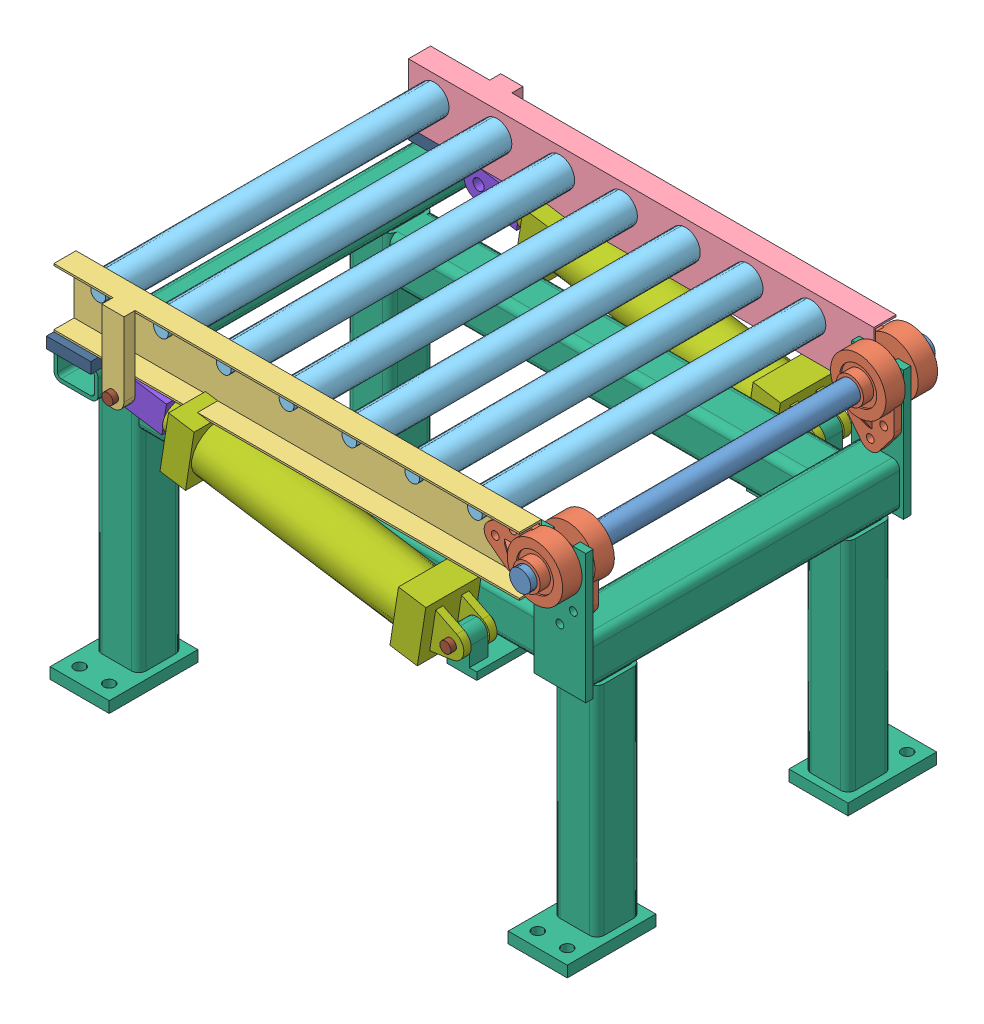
SolidWorks assembly pivoting conv frame.SLDASM, configuration Default (file format 3100). Lengths in mm.
Overall size (889 628.65 704.85).
26 component instances, 11 part files, 35 mates.
Components (placement in the parent):
- pivot shaft-1: pivot shaft.SLDPRT [Default] at (0 -53.975 0) size (36.51 36.51 695.32)
- 3bolt flange1-1: 3bolt flange1.SLDPRT [simple] at (0 -53.975 -266.7) size (95.25 155.58 47.62)
- 3bolt flange1-2: 3bolt flange1.SLDPRT [simple] at (0 -53.975 266.7) x (-1 0 0) z (0 0 -1) size (95.25 155.58 47.62)
- pivot conv-1: pivot conv.SLDASM [Default] at (0 6.35 0) size (873.12 146.05 685.8)
  - pivot_rh_rail1-1: pivot_rh_rail1.SLDPRT [Default] at (-825.5 -12.7 285.75) size (800.1 146.05 57.15)
  - pivot_lh_rail1-1: pivot_lh_rail1.SLDPRT [Default] at (-825.5 -12.7 -285.75) size (800.1 146.05 57.15)
  - conv roller-1: conv roller.SLDPRT [Default] at (-774.7 -44.45 0) size (50.8 50.8 596.9)
  - 3bolt flange1-1: 3bolt flange1.SLDPRT [simple] at (0 -60.325 288.925) x (0 -1 0) z (0 0 1) size (95.25 155.58 47.62)
  - 3bolt flange1-2: 3bolt flange1.SLDPRT [simple] at (0 -60.325 -288.925) x (0 1 0) z (0 0 -1) size (95.25 155.58 47.62)
  - conv roller-8: conv roller.SLDPRT [Default] at (-666.75 -44.45 0) size (50.8 50.8 596.9)
  - conv roller-9: conv roller.SLDPRT [Default] at (-558.8 -44.45 0) size (50.8 50.8 596.9)
  - conv roller-10: conv roller.SLDPRT [Default] at (-450.85 -44.45 0) size (50.8 50.8 596.9)
  - conv roller-11: conv roller.SLDPRT [Default] at (-342.9 -44.45 0) size (50.8 50.8 596.9)
  - conv roller-12: conv roller.SLDPRT [Default] at (-234.95 -44.45 0) size (50.8 50.8 596.9)
  - conv roller-13: conv roller.SLDPRT [Default] at (-127 -44.45 0) size (50.8 50.8 596.9)
- pivot conv frame-1: pivot conv frame.SLDPRT [Default] at origin size (889 609.6 647.7)
- pivot_cylinder-1: pivot_cylinder.SLDPRT [Default] at (-164.7227 -217.3698 304.8) x (0.988116 -0.153707 0) z (0 0 1) size (527.05 95.25 95.25)
- rod_clevis-1: rod_clevis.SLDPRT [Default] at (-635.8301 -144.0864 304.8) x (0.988116 -0.153707 0) z (0 0 1) size (95.25 50.8 38.1)
- pivot cyl rod-1: pivot cyl rod.SLDPRT [Default] at (-234.2595 -206.553 304.8) x (0.988116 -0.153707 0) z (0.107169 0.688946 0.716846) size (444.5 34.92 34.92)
- pivot bumper-1: pivot bumper.SLDPRT [Default] at (-825.5 -127 285.75) size (76.2 19.05 50.8)
- pivot bumper-2: pivot bumper.SLDPRT [Default] at (-825.5 -127 -336.55) size (76.2 19.05 50.8)
- pin .75x3.0-1: pin .75x3.0.SLDPRT [Default] at (-704.85 -133.35 276.225) x (0.350739 -0.936473 0) z (0 0 1) size (19.05 19.05 76.2)
- pin .75x3.0-2: pin .75x3.0.SLDPRT [Default] at (-133.35 -222.25 266.7) x (0.654591 0.755984 0) z (0 0 1) size (19.05 19.05 76.2)
- pivot_cylinder-2: pivot_cylinder.SLDPRT [Default] at (-164.7227 -217.3698 -304.8) x (0.988116 -0.153707 0) z (0 0 1) size (527.05 95.25 95.25)
- rod_clevis-2: rod_clevis.SLDPRT [Default] at (-635.8301 -144.0864 -304.8) x (0.988116 -0.153707 0) z (0 0 1) size (95.25 50.8 38.1)
- pivot cyl rod-2: pivot cyl rod.SLDPRT [Default] at (-234.2595 -206.553 -304.8) x (0.988116 -0.153707 0) z (0.153653 0.98777 -0.026475) size (444.5 34.92 34.92)
Mates (geometry in assembly coordinates):
- Distance4: distance = 53.975 mm aligned: plane of pivot shaft-1; plane of assembly
- Coincident13: coincident aligned: plane of pivot shaft-1; plane of assembly
- Coincident14: coincident aligned: plane of pivot shaft-1; plane of assembly
- Concentric1: concentric anti-aligned: cylinder of pivot shaft-1; cylinder of 3bolt flange1-1
- Distance1 bearing spacing: distance = 19.05 mm anti-aligned: plane of 3bolt flange1-1; plane of pivot conv-1/pivot_lh_rail1-1
- Distance5: distance = 19.05 mm anti-aligned: plane of 3bolt flange1-2; plane of ?
- Concentric2: concentric aligned: cylinder of pivot shaft-1; cylinder of 3bolt flange1-2
- Parallel1: parallel aligned: plane of 3bolt flange1-1; plane of assembly
- Parallel2: parallel aligned: plane of 3bolt flange1-2; plane of assembly
- Concentric3: concentric anti-aligned: cylinder of pivot shaft-1; cylinder of ?
- Coincident1: coincident aligned: plane of ?; plane of assembly
- DOWN POSITION OF CONVEYOR Parallel3: parallel: plane of ?; plane of assembly
- Concentric4: concentric aligned: cylinder of ?; cylinder of rod_clevis-1
- Coincident2: coincident anti-aligned: plane of ?; plane of rod_clevis-1
- Concentric5: concentric aligned: cylinder of rod_clevis-1; cylinder of pivot cyl rod-1
- Coincident3: coincident anti-aligned: plane of rod_clevis-1; plane of pivot cyl rod-1
- Concentric6: concentric aligned: cylinder of pivot_cylinder-1; cylinder of pivot cyl rod-1
- Concentric7: concentric anti-aligned: cylinder of pivot conv frame-1; cylinder of pivot_cylinder-1
- Coincident4: coincident anti-aligned: plane of pivot conv frame-1; plane of pivot bumper-1
- Coincident5: coincident aligned: plane of pivot conv frame-1; plane of pivot bumper-1
- Coincident6: coincident aligned: plane of ?; plane of pivot bumper-1
- Coincident7: coincident anti-aligned: plane of pivot conv frame-1; plane of pivot bumper-2
- Coincident8: coincident aligned: plane of pivot conv frame-1; plane of pivot bumper-2
- Coincident9: coincident aligned: plane of pivot conv-1/pivot_lh_rail1-1; plane of pivot bumper-2
- Concentric8: concentric aligned: cylinder of ?; cylinder of pin .75x3.0-1
- Distance1: distance = 9.525 mm aligned: plane of ?; plane of pin .75x3.0-1
- Distance2: distance = 9.525 mm aligned: plane of pivot_cylinder-1; plane of pin .75x3.0-2
- Concentric9: concentric aligned: cylinder of pivot_cylinder-1; cylinder of pin .75x3.0-2
- Concentric10: concentric aligned: cylinder of pivot conv frame-1; cylinder of pivot_cylinder-2
- Concentric11: concentric anti-aligned: cylinder of pivot conv-1/pivot_lh_rail1-1; cylinder of rod_clevis-2
- Coincident11: coincident anti-aligned: plane of pivot conv-1/pivot_lh_rail1-1; plane of rod_clevis-2
- Concentric12: concentric aligned: cylinder of pivot_cylinder-2; cylinder of pivot cyl rod-2
- Concentric13: concentric aligned: cylinder of rod_clevis-2; cylinder of pivot cyl rod-2
- Coincident12: coincident anti-aligned: plane of rod_clevis-2; plane of pivot cyl rod-2
- Angle1: planar angle = 0 rad aligned: 
